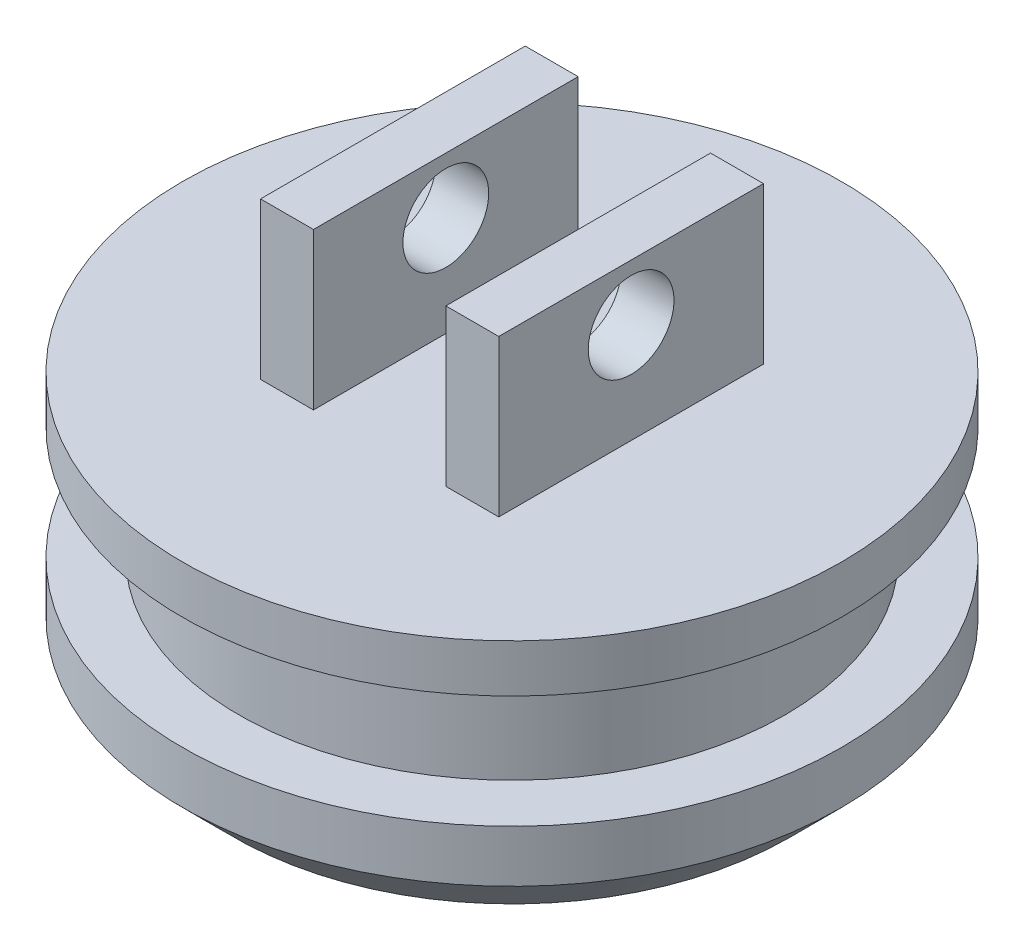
from build123d import *

# Parameters (mm, degrees)
SKETCH2_W      = 2.54
SKETCH2_H      = 12.7
BOLTTAB_DEPTH  = 7.5
SKETCH3_R      = 2.0574
BOLTHOLE_DEPTH = 10
CHAMFER1_SIZE  = 2.5


with BuildPart() as part:
    # Sketch1 → Revolve1 (revolve)
    with BuildSketch(Plane.XY, mode=Mode.PRIVATE) as revolve1_sk:
        Polygon((0, 4.292007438), (-15.8115, 4.292007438), (-15.8115, 1.997107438), (-13.1064, 1.997107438), (-13.1064, -3.413092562), (-15.8115, -3.413092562), (-15.8115, -8.407992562), (0, -8.407992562), align=None)
    revolve(revolve1_sk.sketch.rotate(Axis((0, -8.407992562, 0), (0, 1, 0)), 180), axis=Axis((0, -8.407992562, 0), (0, 1, 0)))

    # Sketch2 → BoltTab (add)
    with BuildSketch(Plane(origin=(0, 4.292007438, 0), x_dir=(1, 0, 0), z_dir=(0, 1, 0))):
        with Locations((-4.445, 0)):
            Rectangle(SKETCH2_W, SKETCH2_H)
    bolttab = extrude(amount=BOLTTAB_DEPTH)

    # Sketch3 → BoltHole (cut)
    with BuildSketch(Plane.ZY.offset(5.715)):
        with Locations((0, 9.094007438)):
            Circle(SKETCH3_R)
    bolthole = extrude(amount=-BOLTHOLE_DEPTH, mode=Mode.SUBTRACT)

    # Mirror1: BoltTab, BoltHole across plane
    add(bolttab.mirror(Plane(origin=(0, 0, 0), x_dir=(0, 0, 1), z_dir=(1, 0, 0))))
    add(bolthole.mirror(Plane(origin=(0, 0, 0), x_dir=(0, 0, 1), z_dir=(1, 0, 0))), mode=Mode.SUBTRACT)

    # Chamfer1
    chamfer1_edges = [part.edges().sort_by_distance(p)[0] for p in [
        (-15.8115, -8.407992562, 0),
    ]]
    chamfer(chamfer1_edges, length=CHAMFER1_SIZE)


solid = part.part
